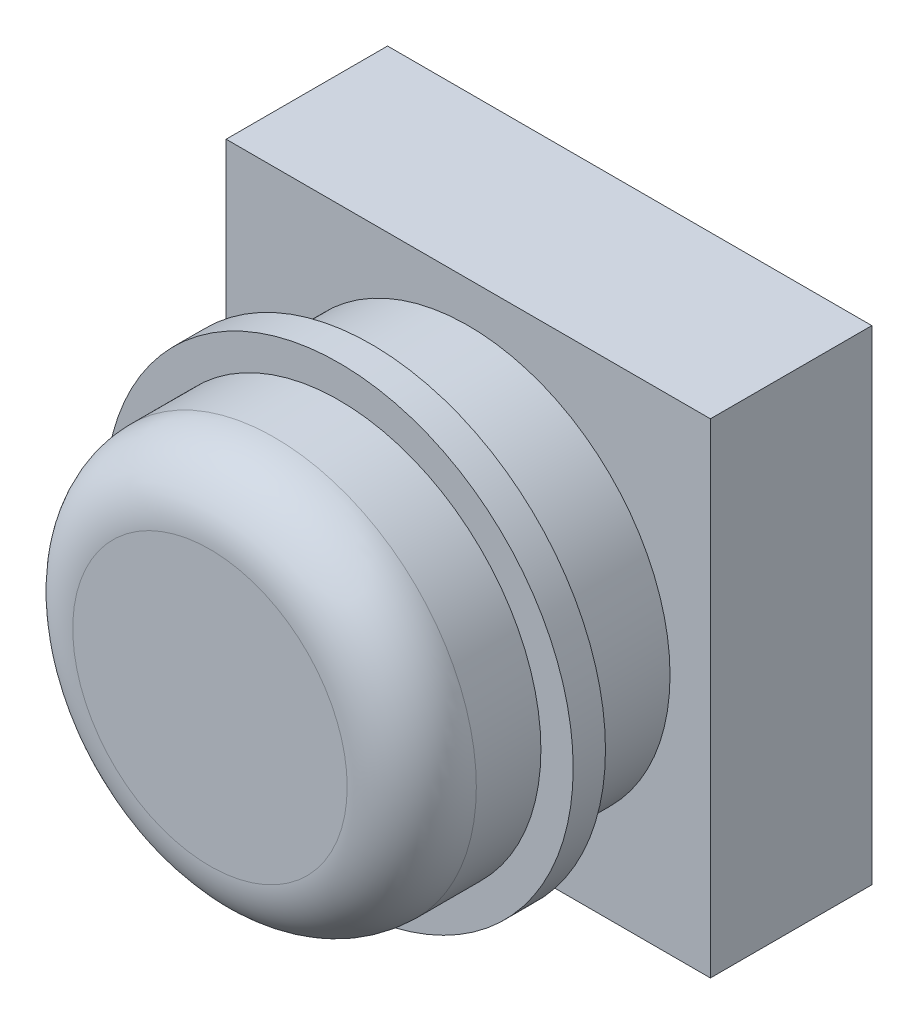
ISO-10303-21;
HEADER;
FILE_DESCRIPTION(('STEP AP214'),'2;1');
FILE_NAME('part.step','',(''),(''),'','','');
FILE_SCHEMA(('AUTOMOTIVE_DESIGN { 1 0 10303 214 1 1 1 1 }'));
ENDSEC;
DATA;
#1=APPLICATION_CONTEXT('core data for automotive mechanical design processes');
#2=APPLICATION_PROTOCOL_DEFINITION('international standard','automotive_design',2000,#1);
#3=PRODUCT_CONTEXT('',#1,'mechanical');
#4=PRODUCT('Part','Part','',(#3));
#5=PRODUCT_RELATED_PRODUCT_CATEGORY('part','',(#4));
#6=PRODUCT_DEFINITION_FORMATION('','',#4);
#7=PRODUCT_DEFINITION_CONTEXT('part definition',#1,'design');
#8=PRODUCT_DEFINITION('design','',#6,#7);
#9=PRODUCT_DEFINITION_SHAPE('','',#8);
#10=(LENGTH_UNIT() NAMED_UNIT(*) SI_UNIT(.MILLI.,.METRE.));
#11=(NAMED_UNIT(*) PLANE_ANGLE_UNIT() SI_UNIT($,.RADIAN.));
#12=(NAMED_UNIT(*) SI_UNIT($,.STERADIAN.) SOLID_ANGLE_UNIT());
#13=UNCERTAINTY_MEASURE_WITH_UNIT(LENGTH_MEASURE(1.E-05),#10,'distance_accuracy_value','');
#14=(GEOMETRIC_REPRESENTATION_CONTEXT(3) GLOBAL_UNCERTAINTY_ASSIGNED_CONTEXT((#13)) GLOBAL_UNIT_ASSIGNED_CONTEXT((#10,
#11,#12)) REPRESENTATION_CONTEXT('',''));
#15=CARTESIAN_POINT('',(0.,0.,0.));
#16=DIRECTION('',(0.,0.,1.));
#17=DIRECTION('',(1.,0.,0.));
#18=AXIS2_PLACEMENT_3D('',#15,#16,#17);
#19=CARTESIAN_POINT('',(0.,0.,13.));
#20=DIRECTION('',(0.,0.,-1.));
#21=DIRECTION('',(-1.,0.,0.));
#22=AXIS2_PLACEMENT_3D('',#19,#20,#21);
#23=CYLINDRICAL_SURFACE('',#22,6.25);
#24=CARTESIAN_POINT('',(0.,0.,5.));
#25=DIRECTION('',(0.,0.,1.));
#26=DIRECTION('',(1.,0.,0.));
#27=AXIS2_PLACEMENT_3D('',#24,#25,#26);
#28=CIRCLE('',#27,6.25);
#29=CARTESIAN_POINT('',(6.25,0.,5.));
#30=VERTEX_POINT('',#29);
#31=EDGE_CURVE('E81',#30,#30,#28,.T.);
#32=ORIENTED_EDGE('',*,*,#31,.T.);
#33=EDGE_LOOP('',(#32));
#34=FACE_BOUND('',#33,.T.);
#35=CARTESIAN_POINT('',(0.,0.,8.));
#36=DIRECTION('',(0.,0.,1.));
#37=DIRECTION('',(1.,0.,0.));
#38=AXIS2_PLACEMENT_3D('',#35,#36,#37);
#39=CIRCLE('',#38,6.25);
#40=CARTESIAN_POINT('',(6.25,0.,8.));
#41=VERTEX_POINT('',#40);
#42=EDGE_CURVE('E11',#41,#41,#39,.T.);
#43=ORIENTED_EDGE('',*,*,#42,.F.);
#44=EDGE_LOOP('',(#43));
#45=FACE_BOUND('',#44,.T.);
#46=ADVANCED_FACE('F29',(#34,#45),#23,.T.);
#47=CARTESIAN_POINT('',(-7.5,-7.5,5.));
#48=DIRECTION('',(0.,0.,-1.));
#49=DIRECTION('',(-1.,0.,0.));
#50=AXIS2_PLACEMENT_3D('',#47,#48,#49);
#51=PLANE('',#50);
#52=DIRECTION('',(0.,-1.,0.));
#53=VECTOR('',#52,1.);
#54=CARTESIAN_POINT('',(-7.5,7.5,5.));
#55=LINE('',#54,#53);
#56=CARTESIAN_POINT('',(-7.5,7.5,5.));
#57=VERTEX_POINT('',#56);
#58=CARTESIAN_POINT('',(-7.5,-7.5,5.));
#59=VERTEX_POINT('',#58);
#60=EDGE_CURVE('E99',#57,#59,#55,.T.);
#61=ORIENTED_EDGE('',*,*,#60,.T.);
#62=DIRECTION('',(-1.,0.,0.));
#63=VECTOR('',#62,1.);
#64=CARTESIAN_POINT('',(7.5,-7.5,5.));
#65=LINE('',#64,#63);
#66=CARTESIAN_POINT('',(7.5,-7.5,5.));
#67=VERTEX_POINT('',#66);
#68=EDGE_CURVE('E78',#67,#59,#65,.T.);
#69=ORIENTED_EDGE('',*,*,#68,.F.);
#70=DIRECTION('',(0.,1.,0.));
#71=VECTOR('',#70,1.);
#72=CARTESIAN_POINT('',(7.5,-7.5,5.));
#73=LINE('',#72,#71);
#74=CARTESIAN_POINT('',(7.5,7.5,5.));
#75=VERTEX_POINT('',#74);
#76=EDGE_CURVE('E102',#67,#75,#73,.T.);
#77=ORIENTED_EDGE('',*,*,#76,.T.);
#78=DIRECTION('',(1.,0.,0.));
#79=VECTOR('',#78,1.);
#80=CARTESIAN_POINT('',(-7.5,7.5,5.));
#81=LINE('',#80,#79);
#82=EDGE_CURVE('E104',#57,#75,#81,.T.);
#83=ORIENTED_EDGE('',*,*,#82,.F.);
#84=EDGE_LOOP('',(#61,#69,#77,#83));
#85=FACE_BOUND('',#84,.T.);
#86=ORIENTED_EDGE('',*,*,#31,.F.);
#87=EDGE_LOOP('',(#86));
#88=FACE_BOUND('',#87,.T.);
#89=ADVANCED_FACE('F134',(#85,#88),#51,.F.);
#90=CARTESIAN_POINT('',(-7.5,7.5,5.));
#91=DIRECTION('',(1.,0.,0.));
#92=DIRECTION('',(0.,1.,0.));
#93=AXIS2_PLACEMENT_3D('',#90,#91,#92);
#94=PLANE('',#93);
#95=DIRECTION('',(0.,0.,-1.));
#96=VECTOR('',#95,1.);
#97=CARTESIAN_POINT('',(-7.5,-7.5,5.));
#98=LINE('',#97,#96);
#99=CARTESIAN_POINT('',(-7.5,-7.5,0.));
#100=VERTEX_POINT('',#99);
#101=EDGE_CURVE('E72',#59,#100,#98,.T.);
#102=ORIENTED_EDGE('',*,*,#101,.F.);
#103=ORIENTED_EDGE('',*,*,#60,.F.);
#104=DIRECTION('',(0.,0.,-1.));
#105=VECTOR('',#104,1.);
#106=CARTESIAN_POINT('',(-7.5,7.5,5.));
#107=LINE('',#106,#105);
#108=CARTESIAN_POINT('',(-7.5,7.5,0.));
#109=VERTEX_POINT('',#108);
#110=EDGE_CURVE('E44',#57,#109,#107,.T.);
#111=ORIENTED_EDGE('',*,*,#110,.T.);
#112=DIRECTION('',(0.,-1.,0.));
#113=VECTOR('',#112,1.);
#114=CARTESIAN_POINT('',(-7.5,7.5,0.));
#115=LINE('',#114,#113);
#116=EDGE_CURVE('E85',#109,#100,#115,.T.);
#117=ORIENTED_EDGE('',*,*,#116,.T.);
#118=EDGE_LOOP('',(#102,#103,#111,#117));
#119=FACE_BOUND('',#118,.T.);
#120=ADVANCED_FACE('F86',(#119),#94,.F.);
#121=CARTESIAN_POINT('',(7.5,-7.5,5.));
#122=DIRECTION('',(0.,-1.,0.));
#123=DIRECTION('',(1.,0.,0.));
#124=AXIS2_PLACEMENT_3D('',#121,#122,#123);
#125=PLANE('',#124);
#126=DIRECTION('',(0.,0.,-1.));
#127=VECTOR('',#126,1.);
#128=CARTESIAN_POINT('',(7.5,-7.5,5.));
#129=LINE('',#128,#127);
#130=CARTESIAN_POINT('',(7.5,-7.5,0.));
#131=VERTEX_POINT('',#130);
#132=EDGE_CURVE('E82',#67,#131,#129,.T.);
#133=ORIENTED_EDGE('',*,*,#132,.F.);
#134=ORIENTED_EDGE('',*,*,#68,.T.);
#135=ORIENTED_EDGE('',*,*,#101,.T.);
#136=DIRECTION('',(-1.,0.,0.));
#137=VECTOR('',#136,1.);
#138=CARTESIAN_POINT('',(7.5,-7.5,0.));
#139=LINE('',#138,#137);
#140=EDGE_CURVE('E75',#131,#100,#139,.T.);
#141=ORIENTED_EDGE('',*,*,#140,.F.);
#142=EDGE_LOOP('',(#133,#134,#135,#141));
#143=FACE_BOUND('',#142,.T.);
#144=ADVANCED_FACE('F31',(#143),#125,.T.);
#145=CARTESIAN_POINT('',(7.5,-7.5,5.));
#146=DIRECTION('',(-1.,0.,0.));
#147=DIRECTION('',(0.,0.,1.));
#148=AXIS2_PLACEMENT_3D('',#145,#146,#147);
#149=PLANE('',#148);
#150=DIRECTION('',(0.,0.,-1.));
#151=VECTOR('',#150,1.);
#152=CARTESIAN_POINT('',(7.5,7.5,5.));
#153=LINE('',#152,#151);
#154=CARTESIAN_POINT('',(7.5,7.5,0.));
#155=VERTEX_POINT('',#154);
#156=EDGE_CURVE('E52',#75,#155,#153,.T.);
#157=ORIENTED_EDGE('',*,*,#156,.F.);
#158=ORIENTED_EDGE('',*,*,#76,.F.);
#159=ORIENTED_EDGE('',*,*,#132,.T.);
#160=DIRECTION('',(0.,1.,0.));
#161=VECTOR('',#160,1.);
#162=CARTESIAN_POINT('',(7.5,-7.5,0.));
#163=LINE('',#162,#161);
#164=EDGE_CURVE('E92',#131,#155,#163,.T.);
#165=ORIENTED_EDGE('',*,*,#164,.T.);
#166=EDGE_LOOP('',(#157,#158,#159,#165));
#167=FACE_BOUND('',#166,.T.);
#168=ADVANCED_FACE('F181',(#167),#149,.F.);
#169=CARTESIAN_POINT('',(-7.5,7.5,5.));
#170=DIRECTION('',(0.,1.,0.));
#171=DIRECTION('',(0.,0.,1.));
#172=AXIS2_PLACEMENT_3D('',#169,#170,#171);
#173=PLANE('',#172);
#174=ORIENTED_EDGE('',*,*,#82,.T.);
#175=ORIENTED_EDGE('',*,*,#156,.T.);
#176=DIRECTION('',(1.,0.,0.));
#177=VECTOR('',#176,1.);
#178=CARTESIAN_POINT('',(-7.5,7.5,0.));
#179=LINE('',#178,#177);
#180=EDGE_CURVE('E94',#109,#155,#179,.T.);
#181=ORIENTED_EDGE('',*,*,#180,.F.);
#182=ORIENTED_EDGE('',*,*,#110,.F.);
#183=EDGE_LOOP('',(#174,#175,#181,#182));
#184=FACE_BOUND('',#183,.T.);
#185=ADVANCED_FACE('F177',(#184),#173,.T.);
#186=CARTESIAN_POINT('',(-7.5,-7.5,0.));
#187=DIRECTION('',(0.,0.,-1.));
#188=DIRECTION('',(-1.,0.,0.));
#189=AXIS2_PLACEMENT_3D('',#186,#187,#188);
#190=PLANE('',#189);
#191=ORIENTED_EDGE('',*,*,#116,.F.);
#192=ORIENTED_EDGE('',*,*,#180,.T.);
#193=ORIENTED_EDGE('',*,*,#164,.F.);
#194=ORIENTED_EDGE('',*,*,#140,.T.);
#195=EDGE_LOOP('',(#191,#192,#193,#194));
#196=FACE_BOUND('',#195,.T.);
#197=ADVANCED_FACE('F91',(#196),#190,.T.);
#198=CARTESIAN_POINT('',(0.,0.,9.));
#199=DIRECTION('',(0.,0.,1.));
#200=DIRECTION('',(1.,0.,0.));
#201=AXIS2_PLACEMENT_3D('',#198,#199,#200);
#202=PLANE('',#201);
#203=CARTESIAN_POINT('',(0.,0.,9.));
#204=DIRECTION('',(0.,0.,1.));
#205=DIRECTION('',(1.,0.,0.));
#206=AXIS2_PLACEMENT_3D('',#203,#204,#205);
#207=CIRCLE('',#206,7.25);
#208=CARTESIAN_POINT('',(7.25,0.,9.));
#209=VERTEX_POINT('',#208);
#210=EDGE_CURVE('E89',#209,#209,#207,.T.);
#211=ORIENTED_EDGE('',*,*,#210,.T.);
#212=EDGE_LOOP('',(#211));
#213=FACE_BOUND('',#212,.T.);
#214=CARTESIAN_POINT('',(0.,0.,9.));
#215=DIRECTION('',(0.,0.,1.));
#216=DIRECTION('',(1.,0.,0.));
#217=AXIS2_PLACEMENT_3D('',#214,#215,#216);
#218=CIRCLE('',#217,6.25);
#219=CARTESIAN_POINT('',(6.25,0.,9.));
#220=VERTEX_POINT('',#219);
#221=EDGE_CURVE('E150',#220,#220,#218,.T.);
#222=ORIENTED_EDGE('',*,*,#221,.F.);
#223=EDGE_LOOP('',(#222));
#224=FACE_BOUND('',#223,.T.);
#225=ADVANCED_FACE('F162',(#213,#224),#202,.T.);
#226=CARTESIAN_POINT('',(0.,0.,8.));
#227=DIRECTION('',(0.,0.,1.));
#228=DIRECTION('',(1.,0.,0.));
#229=AXIS2_PLACEMENT_3D('',#226,#227,#228);
#230=PLANE('',#229);
#231=CARTESIAN_POINT('',(0.,0.,8.));
#232=DIRECTION('',(0.,0.,1.));
#233=DIRECTION('',(1.,0.,0.));
#234=AXIS2_PLACEMENT_3D('',#231,#232,#233);
#235=CIRCLE('',#234,7.25);
#236=CARTESIAN_POINT('',(7.25,0.,8.));
#237=VERTEX_POINT('',#236);
#238=EDGE_CURVE('E152',#237,#237,#235,.T.);
#239=ORIENTED_EDGE('',*,*,#238,.F.);
#240=EDGE_LOOP('',(#239));
#241=FACE_BOUND('',#240,.T.);
#242=ORIENTED_EDGE('',*,*,#42,.T.);
#243=EDGE_LOOP('',(#242));
#244=FACE_BOUND('',#243,.T.);
#245=ADVANCED_FACE('F129',(#241,#244),#230,.F.);
#246=CARTESIAN_POINT('',(0.,0.,9.));
#247=DIRECTION('',(0.,0.,-1.));
#248=DIRECTION('',(-1.,0.,0.));
#249=AXIS2_PLACEMENT_3D('',#246,#247,#248);
#250=CYLINDRICAL_SURFACE('',#249,7.25);
#251=ORIENTED_EDGE('',*,*,#210,.F.);
#252=EDGE_LOOP('',(#251));
#253=FACE_BOUND('',#252,.T.);
#254=ORIENTED_EDGE('',*,*,#238,.T.);
#255=EDGE_LOOP('',(#254));
#256=FACE_BOUND('',#255,.T.);
#257=ADVANCED_FACE('F124',(#253,#256),#250,.T.);
#258=CARTESIAN_POINT('',(0.,0.,13.));
#259=DIRECTION('',(0.,0.,1.));
#260=DIRECTION('',(1.,0.,0.));
#261=AXIS2_PLACEMENT_3D('',#258,#259,#260);
#262=PLANE('',#261);
#263=CARTESIAN_POINT('',(0.,0.,13.));
#264=DIRECTION('',(0.,0.,1.));
#265=DIRECTION('',(1.,0.,0.));
#266=AXIS2_PLACEMENT_3D('',#263,#264,#265);
#267=CIRCLE('',#266,4.25);
#268=CARTESIAN_POINT('',(4.25,0.,13.));
#269=VERTEX_POINT('',#268);
#270=EDGE_CURVE('E109',#269,#269,#267,.T.);
#271=ORIENTED_EDGE('',*,*,#270,.T.);
#272=EDGE_LOOP('',(#271));
#273=FACE_BOUND('',#272,.T.);
#274=ADVANCED_FACE('F119',(#273),#262,.T.);
#275=CARTESIAN_POINT('',(0.,0.,11.));
#276=DIRECTION('',(0.,0.,1.));
#277=DIRECTION('',(1.,0.,0.));
#278=AXIS2_PLACEMENT_3D('',#275,#276,#277);
#279=TOROIDAL_SURFACE('',#278,4.25,2.);
#280=CARTESIAN_POINT('',(0.,0.,11.));
#281=DIRECTION('',(0.,0.,1.));
#282=DIRECTION('',(1.,0.,0.));
#283=AXIS2_PLACEMENT_3D('',#280,#281,#282);
#284=CIRCLE('',#283,6.25);
#285=CARTESIAN_POINT('',(6.25,0.,11.));
#286=VERTEX_POINT('',#285);
#287=EDGE_CURVE('E37',#286,#286,#284,.F.);
#288=ORIENTED_EDGE('',*,*,#287,.F.);
#289=EDGE_LOOP('',(#288));
#290=FACE_BOUND('',#289,.T.);
#291=ORIENTED_EDGE('',*,*,#270,.F.);
#292=EDGE_LOOP('',(#291));
#293=FACE_BOUND('',#292,.T.);
#294=ADVANCED_FACE('F116',(#290,#293),#279,.T.);
#295=ORIENTED_EDGE('',*,*,#221,.T.);
#296=EDGE_LOOP('',(#295));
#297=FACE_BOUND('',#296,.T.);
#298=ORIENTED_EDGE('',*,*,#287,.T.);
#299=EDGE_LOOP('',(#298));
#300=FACE_BOUND('',#299,.T.);
#301=ADVANCED_FACE('F114',(#297,#300),#23,.T.);
#302=CLOSED_SHELL('',(#46,#89,#120,#144,#168,#185,#197,#225,#245,#257,#274,#294,#301));
#303=MANIFOLD_SOLID_BREP('B2',#302);
#304=ADVANCED_BREP_SHAPE_REPRESENTATION('',(#18,#303),#14);
#305=SHAPE_DEFINITION_REPRESENTATION(#9,#304);
ENDSEC;
END-ISO-10303-21;
